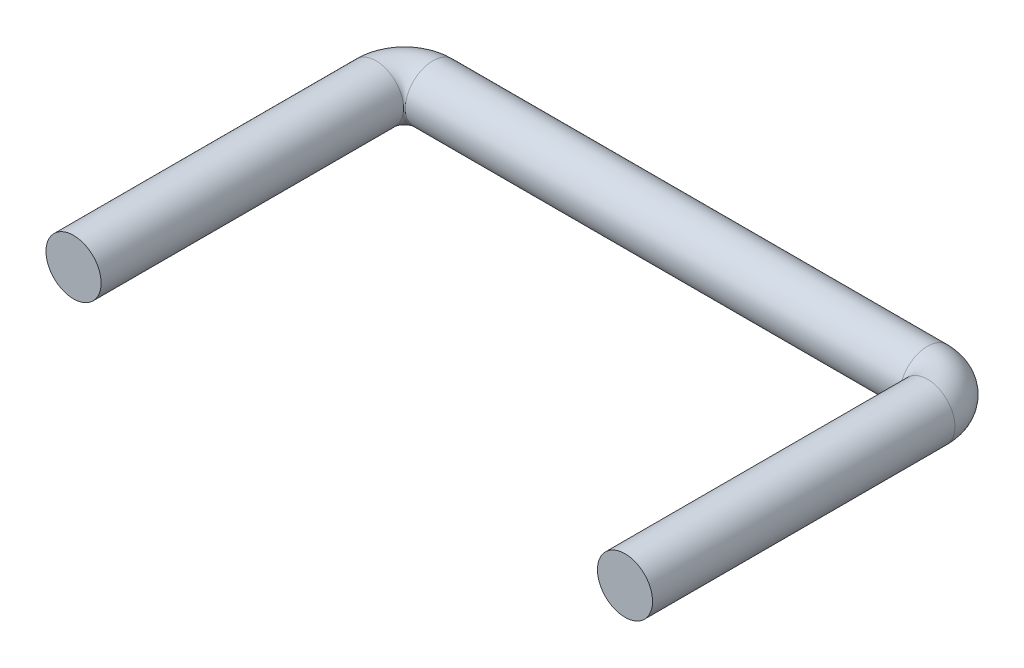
ISO-10303-21;
HEADER;
FILE_DESCRIPTION(('STEP AP214'),'2;1');
FILE_NAME('part.step','',(''),(''),'','','');
FILE_SCHEMA(('AUTOMOTIVE_DESIGN { 1 0 10303 214 1 1 1 1 }'));
ENDSEC;
DATA;
#1=APPLICATION_CONTEXT('core data for automotive mechanical design processes');
#2=APPLICATION_PROTOCOL_DEFINITION('international standard','automotive_design',2000,#1);
#3=PRODUCT_CONTEXT('',#1,'mechanical');
#4=PRODUCT('Part','Part','',(#3));
#5=PRODUCT_RELATED_PRODUCT_CATEGORY('part','',(#4));
#6=PRODUCT_DEFINITION_FORMATION('','',#4);
#7=PRODUCT_DEFINITION_CONTEXT('part definition',#1,'design');
#8=PRODUCT_DEFINITION('design','',#6,#7);
#9=PRODUCT_DEFINITION_SHAPE('','',#8);
#10=(LENGTH_UNIT() NAMED_UNIT(*) SI_UNIT(.MILLI.,.METRE.));
#11=(NAMED_UNIT(*) PLANE_ANGLE_UNIT() SI_UNIT($,.RADIAN.));
#12=(NAMED_UNIT(*) SI_UNIT($,.STERADIAN.) SOLID_ANGLE_UNIT());
#13=UNCERTAINTY_MEASURE_WITH_UNIT(LENGTH_MEASURE(1.E-05),#10,'distance_accuracy_value','');
#14=(GEOMETRIC_REPRESENTATION_CONTEXT(3) GLOBAL_UNCERTAINTY_ASSIGNED_CONTEXT((#13)) GLOBAL_UNIT_ASSIGNED_CONTEXT((#10,
#11,#12)) REPRESENTATION_CONTEXT('',''));
#15=CARTESIAN_POINT('',(0.,0.,0.));
#16=DIRECTION('',(0.,0.,1.));
#17=DIRECTION('',(1.,0.,0.));
#18=AXIS2_PLACEMENT_3D('',#15,#16,#17);
#19=CARTESIAN_POINT('',(-11.0961472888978,0.,-37.3635889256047));
#20=DIRECTION('',(0.,0.,1.));
#21=DIRECTION('',(1.,0.,0.));
#22=AXIS2_PLACEMENT_3D('',#19,#20,#21);
#23=CYLINDRICAL_SURFACE('',#22,0.79375);
#24=CARTESIAN_POINT('',(-11.0961472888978,0.,-37.3635889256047));
#25=DIRECTION('',(0.,0.,1.));
#26=DIRECTION('',(1.,0.,0.));
#27=AXIS2_PLACEMENT_3D('',#24,#25,#26);
#28=CIRCLE('',#27,0.79375);
#29=CARTESIAN_POINT('',(-10.3023972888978,0.,-37.3635889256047));
#30=VERTEX_POINT('',#29);
#31=EDGE_CURVE('E35',#30,#30,#28,.T.);
#32=ORIENTED_EDGE('',*,*,#31,.T.);
#33=EDGE_LOOP('',(#32));
#34=FACE_BOUND('',#33,.T.);
#35=CARTESIAN_POINT('',(-11.0961472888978,0.,-28.6551989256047));
#36=DIRECTION('',(0.,0.,1.));
#37=DIRECTION('',(1.,0.,0.));
#38=AXIS2_PLACEMENT_3D('',#35,#36,#37);
#39=CIRCLE('',#38,0.79375);
#40=CARTESIAN_POINT('',(-10.3023972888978,0.,-28.6551989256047));
#41=VERTEX_POINT('',#40);
#42=EDGE_CURVE('E10',#41,#41,#39,.T.);
#43=ORIENTED_EDGE('',*,*,#42,.F.);
#44=EDGE_LOOP('',(#43));
#45=FACE_BOUND('',#44,.T.);
#46=ADVANCED_FACE('F29',(#34,#45),#23,.T.);
#47=CARTESIAN_POINT('',(-11.915334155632,0.,-37.3635889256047));
#48=DIRECTION('',(0.,-1.,0.));
#49=DIRECTION('',(0.,0.,-1.));
#50=AXIS2_PLACEMENT_3D('',#47,#48,#49);
#51=TOROIDAL_SURFACE('',#50,0.819186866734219,0.79375);
#52=CARTESIAN_POINT('',(-11.915334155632,0.,-38.182775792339));
#53=DIRECTION('',(1.,0.,0.));
#54=DIRECTION('',(0.,0.,-1.));
#55=AXIS2_PLACEMENT_3D('',#52,#53,#54);
#56=CIRCLE('',#55,0.79375);
#57=CARTESIAN_POINT('',(-11.915334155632,0.,-38.976525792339));
#58=VERTEX_POINT('',#57);
#59=EDGE_CURVE('E39',#58,#58,#56,.T.);
#60=CARTESIAN_POINT('',(-11.915334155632,0.,-37.3635889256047));
#61=DIRECTION('',(0.,-1.,0.));
#62=DIRECTION('',(0.,0.,-1.));
#63=AXIS2_PLACEMENT_3D('',#60,#61,#62);
#64=CIRCLE('',#63,1.61293686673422);
#65=EDGE_CURVE('',#58,#30,#64,.T.);
#66=ORIENTED_EDGE('',*,*,#59,.T.);
#67=ORIENTED_EDGE('',*,*,#31,.F.);
#68=ORIENTED_EDGE('',*,*,#65,.T.);
#69=ORIENTED_EDGE('',*,*,#65,.F.);
#70=EDGE_LOOP('',(#66,#68,#67,#69));
#71=FACE_BOUND('',#70,.T.);
#72=ADVANCED_FACE('F73',(#71),#51,.T.);
#73=CARTESIAN_POINT('',(-26.157114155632,0.,-38.182775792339));
#74=DIRECTION('',(1.,0.,0.));
#75=DIRECTION('',(0.,0.,-1.));
#76=AXIS2_PLACEMENT_3D('',#73,#74,#75);
#77=CYLINDRICAL_SURFACE('',#76,0.79375);
#78=CARTESIAN_POINT('',(-26.157114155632,0.,-38.182775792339));
#79=DIRECTION('',(1.,0.,0.));
#80=DIRECTION('',(0.,0.,-1.));
#81=AXIS2_PLACEMENT_3D('',#78,#79,#80);
#82=CIRCLE('',#81,0.79375);
#83=CARTESIAN_POINT('',(-26.157114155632,0.,-38.976525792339));
#84=VERTEX_POINT('',#83);
#85=EDGE_CURVE('E43',#84,#84,#82,.T.);
#86=ORIENTED_EDGE('',*,*,#85,.T.);
#87=EDGE_LOOP('',(#86));
#88=FACE_BOUND('',#87,.T.);
#89=ORIENTED_EDGE('',*,*,#59,.F.);
#90=EDGE_LOOP('',(#89));
#91=FACE_BOUND('',#90,.T.);
#92=ADVANCED_FACE('F77',(#88,#91),#77,.T.);
#93=CARTESIAN_POINT('',(-26.157114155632,0.,-37.3635889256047));
#94=DIRECTION('',(0.,-1.,0.));
#95=DIRECTION('',(0.,0.,-1.));
#96=AXIS2_PLACEMENT_3D('',#93,#94,#95);
#97=TOROIDAL_SURFACE('',#96,0.819186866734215,0.79375);
#98=CARTESIAN_POINT('',(-26.9763010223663,0.,-37.3635889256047));
#99=DIRECTION('',(0.,0.,-1.));
#100=DIRECTION('',(-1.,0.,0.));
#101=AXIS2_PLACEMENT_3D('',#98,#99,#100);
#102=CIRCLE('',#101,0.79375);
#103=CARTESIAN_POINT('',(-27.7700510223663,0.,-37.3635889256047));
#104=VERTEX_POINT('',#103);
#105=EDGE_CURVE('E48',#104,#104,#102,.T.);
#106=CARTESIAN_POINT('',(-26.157114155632,0.,-37.3635889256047));
#107=DIRECTION('',(0.,-1.,0.));
#108=DIRECTION('',(0.,0.,-1.));
#109=AXIS2_PLACEMENT_3D('',#106,#107,#108);
#110=CIRCLE('',#109,1.61293686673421);
#111=EDGE_CURVE('',#104,#84,#110,.T.);
#112=ORIENTED_EDGE('',*,*,#105,.T.);
#113=ORIENTED_EDGE('',*,*,#85,.F.);
#114=ORIENTED_EDGE('',*,*,#111,.T.);
#115=ORIENTED_EDGE('',*,*,#111,.F.);
#116=EDGE_LOOP('',(#112,#114,#113,#115));
#117=FACE_BOUND('',#116,.T.);
#118=ADVANCED_FACE('F55',(#117),#97,.T.);
#119=CARTESIAN_POINT('',(-26.9763010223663,0.,-37.3635889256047));
#120=DIRECTION('',(0.,0.,1.));
#121=DIRECTION('',(1.,0.,0.));
#122=AXIS2_PLACEMENT_3D('',#119,#120,#121);
#123=CYLINDRICAL_SURFACE('',#122,0.79375);
#124=ORIENTED_EDGE('',*,*,#105,.F.);
#125=EDGE_LOOP('',(#124));
#126=FACE_BOUND('',#125,.T.);
#127=CARTESIAN_POINT('',(-26.9763010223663,0.,-28.6551989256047));
#128=DIRECTION('',(0.,0.,-1.));
#129=DIRECTION('',(-1.,0.,0.));
#130=AXIS2_PLACEMENT_3D('',#127,#128,#129);
#131=CIRCLE('',#130,0.79375);
#132=CARTESIAN_POINT('',(-27.7700510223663,0.,-28.6551989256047));
#133=VERTEX_POINT('',#132);
#134=EDGE_CURVE('E49',#133,#133,#131,.T.);
#135=ORIENTED_EDGE('',*,*,#134,.T.);
#136=EDGE_LOOP('',(#135));
#137=FACE_BOUND('',#136,.T.);
#138=ADVANCED_FACE('F58',(#126,#137),#123,.T.);
#139=CARTESIAN_POINT('',(-11.0961472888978,0.,-28.6551989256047));
#140=DIRECTION('',(0.,0.,1.));
#141=DIRECTION('',(1.,0.,0.));
#142=AXIS2_PLACEMENT_3D('',#139,#140,#141);
#143=PLANE('',#142);
#144=ORIENTED_EDGE('',*,*,#42,.T.);
#145=EDGE_LOOP('',(#144));
#146=FACE_BOUND('',#145,.T.);
#147=ADVANCED_FACE('F61',(#146),#143,.T.);
#148=CARTESIAN_POINT('',(-26.9763010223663,0.,-28.6551989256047));
#149=DIRECTION('',(0.,0.,-1.));
#150=DIRECTION('',(-1.,0.,0.));
#151=AXIS2_PLACEMENT_3D('',#148,#149,#150);
#152=PLANE('',#151);
#153=ORIENTED_EDGE('',*,*,#134,.F.);
#154=EDGE_LOOP('',(#153));
#155=FACE_BOUND('',#154,.T.);
#156=ADVANCED_FACE('F65',(#155),#152,.F.);
#157=CLOSED_SHELL('',(#46,#72,#92,#118,#138,#147,#156));
#158=MANIFOLD_SOLID_BREP('B2',#157);
#159=ADVANCED_BREP_SHAPE_REPRESENTATION('',(#18,#158),#14);
#160=SHAPE_DEFINITION_REPRESENTATION(#9,#159);
ENDSEC;
END-ISO-10303-21;
